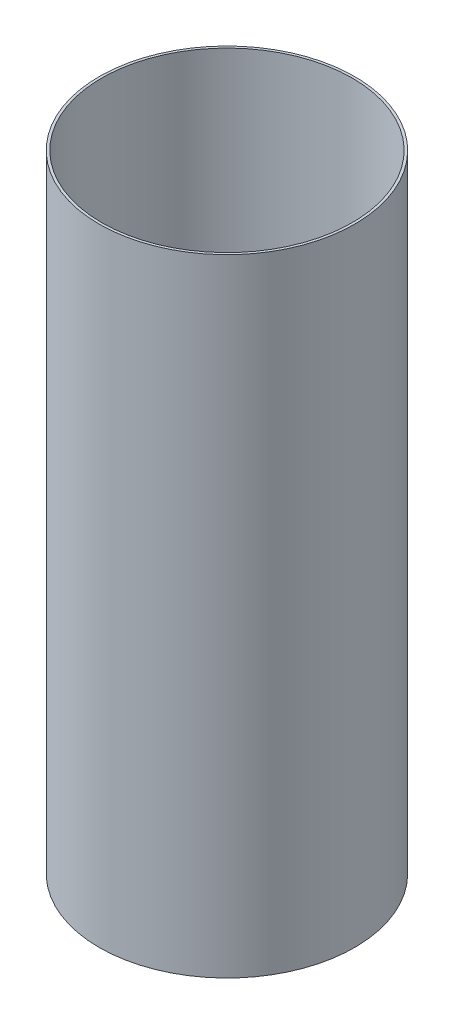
from build123d import *

# Parameters (mm, degrees)
SKETCH1_R           = 1.2954
SKETCH1_R_2         = 1.27
BOSS_EXTRUDE1_DEPTH = 6.35


with BuildPart() as part:
    # Sketch1 → Boss-Extrude1 (new body)
    with BuildSketch(Plane(origin=(0, 0, 0), x_dir=(1, 0, 0), z_dir=(0, 1, 0))):
        with Locations(Location((0, 0, 0), (0, 0, 270))):
            Circle(SKETCH1_R)
        with Locations(Location((0, 0, 0), (0, 0, 270))):
            Circle(SKETCH1_R_2, mode=Mode.SUBTRACT)
    extrude(amount=BOSS_EXTRUDE1_DEPTH)


solid = part.part
